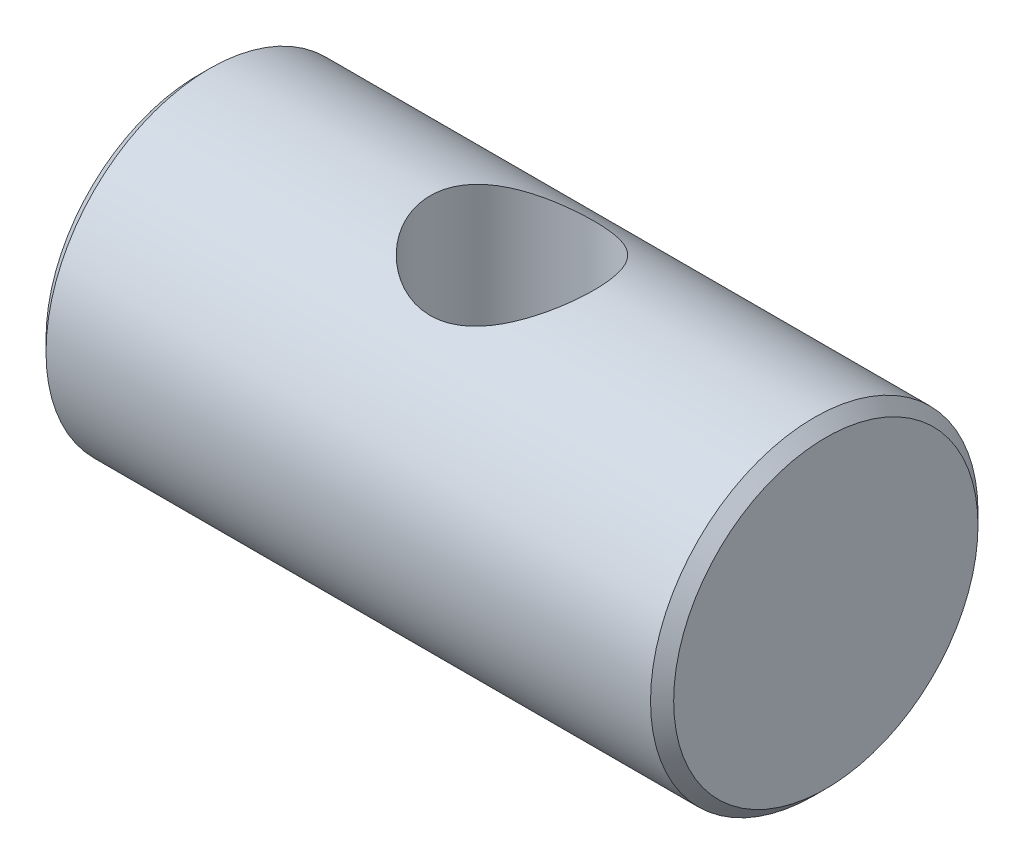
ISO-10303-21;
HEADER;
FILE_DESCRIPTION(('STEP AP214'),'2;1');
FILE_NAME('part.step','',(''),(''),'','','');
FILE_SCHEMA(('AUTOMOTIVE_DESIGN { 1 0 10303 214 1 1 1 1 }'));
ENDSEC;
DATA;
#1=APPLICATION_CONTEXT('core data for automotive mechanical design processes');
#2=APPLICATION_PROTOCOL_DEFINITION('international standard','automotive_design',2000,#1);
#3=PRODUCT_CONTEXT('',#1,'mechanical');
#4=PRODUCT('Part','Part','',(#3));
#5=PRODUCT_RELATED_PRODUCT_CATEGORY('part','',(#4));
#6=PRODUCT_DEFINITION_FORMATION('','',#4);
#7=PRODUCT_DEFINITION_CONTEXT('part definition',#1,'design');
#8=PRODUCT_DEFINITION('design','',#6,#7);
#9=PRODUCT_DEFINITION_SHAPE('','',#8);
#10=(LENGTH_UNIT() NAMED_UNIT(*) SI_UNIT(.MILLI.,.METRE.));
#11=(NAMED_UNIT(*) PLANE_ANGLE_UNIT() SI_UNIT($,.RADIAN.));
#12=(NAMED_UNIT(*) SI_UNIT($,.STERADIAN.) SOLID_ANGLE_UNIT());
#13=UNCERTAINTY_MEASURE_WITH_UNIT(LENGTH_MEASURE(1.E-05),#10,'distance_accuracy_value','');
#14=(GEOMETRIC_REPRESENTATION_CONTEXT(3) GLOBAL_UNCERTAINTY_ASSIGNED_CONTEXT((#13)) GLOBAL_UNIT_ASSIGNED_CONTEXT((#10,
#11,#12)) REPRESENTATION_CONTEXT('',''));
#15=CARTESIAN_POINT('',(0.,0.,0.));
#16=DIRECTION('',(0.,0.,1.));
#17=DIRECTION('',(1.,0.,0.));
#18=AXIS2_PLACEMENT_3D('',#15,#16,#17);
#19=CARTESIAN_POINT('',(5.75,2.78786796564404,0.));
#20=DIRECTION('',(-1.,0.,0.));
#21=DIRECTION('',(0.,0.,1.));
#22=AXIS2_PLACEMENT_3D('',#19,#20,#21);
#23=PLANE('',#22);
#24=CARTESIAN_POINT('',(5.74999999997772,0.,0.));
#25=DIRECTION('',(-1.,0.,0.));
#26=DIRECTION('',(0.,0.,1.));
#27=AXIS2_PLACEMENT_3D('',#24,#25,#26);
#28=CIRCLE('',#27,2.78786796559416);
#29=CARTESIAN_POINT('',(5.74999999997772,0.,-2.78786796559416));
#30=VERTEX_POINT('',#29);
#31=EDGE_CURVE('E31',#30,#30,#28,.T.);
#32=ORIENTED_EDGE('',*,*,#31,.F.);
#33=EDGE_LOOP('',(#32));
#34=FACE_BOUND('',#33,.T.);
#35=ADVANCED_FACE('F14',(#34),#23,.F.);
#36=CARTESIAN_POINT('',(-5.75,0.,0.));
#37=DIRECTION('',(1.,0.,0.));
#38=DIRECTION('',(0.,0.,-1.));
#39=AXIS2_PLACEMENT_3D('',#36,#37,#38);
#40=PLANE('',#39);
#41=CARTESIAN_POINT('',(-5.75000000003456,0.,0.));
#42=DIRECTION('',(1.,0.,0.));
#43=DIRECTION('',(0.,0.,-1.));
#44=AXIS2_PLACEMENT_3D('',#41,#42,#43);
#45=CIRCLE('',#44,2.78786796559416);
#46=CARTESIAN_POINT('',(-5.75000000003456,0.,-2.78786796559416));
#47=VERTEX_POINT('',#46);
#48=EDGE_CURVE('E44',#47,#47,#45,.T.);
#49=ORIENTED_EDGE('',*,*,#48,.F.);
#50=EDGE_LOOP('',(#49));
#51=FACE_BOUND('',#50,.T.);
#52=ADVANCED_FACE('F45',(#51),#40,.F.);
#53=CARTESIAN_POINT('',(5.53786796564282,0.,0.));
#54=DIRECTION('',(-1.,0.,0.));
#55=DIRECTION('',(0.,0.,1.));
#56=AXIS2_PLACEMENT_3D('',#53,#54,#55);
#57=CONICAL_SURFACE('',#56,2.99999999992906,0.785398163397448);
#58=CARTESIAN_POINT('',(5.53786796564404,0.,0.));
#59=DIRECTION('',(1.,0.,0.));
#60=DIRECTION('',(0.,0.,-1.));
#61=AXIS2_PLACEMENT_3D('',#58,#59,#60);
#62=CIRCLE('',#61,3.);
#63=CARTESIAN_POINT('',(5.53786796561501,0.,-2.99999999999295));
#64=VERTEX_POINT('',#63);
#65=EDGE_CURVE('E37',#64,#64,#62,.T.);
#66=ORIENTED_EDGE('',*,*,#65,.T.);
#67=EDGE_LOOP('',(#66));
#68=FACE_BOUND('',#67,.T.);
#69=ORIENTED_EDGE('',*,*,#31,.T.);
#70=EDGE_LOOP('',(#69));
#71=FACE_BOUND('',#70,.T.);
#72=ADVANCED_FACE('F75',(#68,#71),#57,.T.);
#73=CARTESIAN_POINT('',(5.75,0.,0.));
#74=DIRECTION('',(1.,0.,0.));
#75=DIRECTION('',(0.,0.,-1.));
#76=AXIS2_PLACEMENT_3D('',#73,#74,#75);
#77=CYLINDRICAL_SURFACE('',#76,3.);
#78=CARTESIAN_POINT('',(1.5,-3.00000000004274,0.));
#79=CARTESIAN_POINT('',(1.49999504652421,-2.99999570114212,0.0788579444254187));
#80=CARTESIAN_POINT('',(1.49374489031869,-2.99685736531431,0.157809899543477));
#81=CARTESIAN_POINT('',(1.46902067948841,-2.98461234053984,0.313380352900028));
#82=CARTESIAN_POINT('',(1.45052341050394,-2.97549431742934,0.389994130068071));
#83=CARTESIAN_POINT('',(1.40220928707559,-2.95224419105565,0.538400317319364));
#84=CARTESIAN_POINT('',(1.37243642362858,-2.93813158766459,0.610210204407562));
#85=CARTESIAN_POINT('',(1.3026440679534,-2.90618664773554,0.747708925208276));
#86=CARTESIAN_POINT('',(1.26262538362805,-2.88835460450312,0.813398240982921));
#87=CARTESIAN_POINT('',(1.17072412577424,-2.8493438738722,0.941261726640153));
#88=CARTESIAN_POINT('',(1.118270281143,-2.82802798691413,1.00298281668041));
#89=CARTESIAN_POINT('',(1.00421778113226,-2.78489955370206,1.11716916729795));
#90=CARTESIAN_POINT('',(0.942612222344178,-2.76308664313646,1.16962737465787));
#91=CARTESIAN_POINT('',(0.806274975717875,-2.71948426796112,1.26787800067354));
#92=CARTESIAN_POINT('',(0.730895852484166,-2.69782780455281,1.31283800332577));
#93=CARTESIAN_POINT('',(0.572448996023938,-2.65928968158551,1.3892523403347));
#94=CARTESIAN_POINT('',(0.489386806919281,-2.64240461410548,1.42071632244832));
#95=CARTESIAN_POINT('',(0.323002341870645,-2.61686800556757,1.46719866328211));
#96=CARTESIAN_POINT('',(0.23999332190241,-2.60778407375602,1.4830887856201));
#97=CARTESIAN_POINT('',(0.072031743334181,-2.59772834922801,1.50064048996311));
#98=CARTESIAN_POINT('',(-0.0129188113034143,-2.5967485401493,1.50231613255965));
#99=CARTESIAN_POINT('',(-0.17142903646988,-2.60266395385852,1.49203093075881));
#100=CARTESIAN_POINT('',(-0.245136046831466,-2.60863145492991,1.48167683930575));
#101=CARTESIAN_POINT('',(-0.389582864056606,-2.62614343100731,1.4504097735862));
#102=CARTESIAN_POINT('',(-0.460321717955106,-2.63768968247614,1.4294934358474));
#103=CARTESIAN_POINT('',(-0.598843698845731,-2.6653121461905,1.3773146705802));
#104=CARTESIAN_POINT('',(-0.666519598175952,-2.6814876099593,1.34582260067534));
#105=CARTESIAN_POINT('',(-0.795951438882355,-2.71655106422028,1.27356253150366));
#106=CARTESIAN_POINT('',(-0.857704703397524,-2.73544027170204,1.23279036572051));
#107=CARTESIAN_POINT('',(-0.981781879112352,-2.77669736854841,1.13709908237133));
#108=CARTESIAN_POINT('',(-1.04318531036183,-2.79920265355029,1.08104168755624));
#109=CARTESIAN_POINT('',(-1.15610312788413,-2.8432143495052,0.959333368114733));
#110=CARTESIAN_POINT('',(-1.20761278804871,-2.86472027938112,0.893677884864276));
#111=CARTESIAN_POINT('',(-1.30152849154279,-2.90552980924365,0.750774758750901));
#112=CARTESIAN_POINT('',(-1.34340070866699,-2.92468476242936,0.673130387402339));
#113=CARTESIAN_POINT('',(-1.41314554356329,-2.95736821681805,0.51069932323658));
#114=CARTESIAN_POINT('',(-1.44102927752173,-2.9709011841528,0.425918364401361));
#115=CARTESIAN_POINT('',(-1.47971310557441,-2.98986500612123,0.259149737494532));
#116=CARTESIAN_POINT('',(-1.49173685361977,-2.99587407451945,0.177512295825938));
#117=CARTESIAN_POINT('',(-1.50219709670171,-3.00109520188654,0.013169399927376));
#118=CARTESIAN_POINT('',(-1.50064002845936,-3.00031048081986,-0.0695355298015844));
#119=CARTESIAN_POINT('',(-1.48468996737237,-2.99236788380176,-0.226849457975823));
#120=CARTESIAN_POINT('',(-1.47130120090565,-2.98570868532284,-0.301589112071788));
#121=CARTESIAN_POINT('',(-1.43364289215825,-2.96733256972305,-0.447610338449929));
#122=CARTESIAN_POINT('',(-1.40937215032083,-2.95561509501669,-0.518891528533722));
#123=CARTESIAN_POINT('',(-1.35000230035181,-2.92776377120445,-0.658332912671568));
#124=CARTESIAN_POINT('',(-1.31461342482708,-2.91151322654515,-0.726345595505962));
#125=CARTESIAN_POINT('',(-1.23433869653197,-2.87615961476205,-0.855692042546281));
#126=CARTESIAN_POINT('',(-1.18944879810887,-2.8570553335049,-0.91702294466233));
#127=CARTESIAN_POINT('',(-1.08635936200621,-2.81562332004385,-1.03765153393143));
#128=CARTESIAN_POINT('',(-1.02728569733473,-2.79316327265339,-1.09615811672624));
#129=CARTESIAN_POINT('',(-0.900112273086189,-2.74893587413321,-1.2027844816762));
#130=CARTESIAN_POINT('',(-0.832006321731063,-2.72716901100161,-1.25089707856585));
#131=CARTESIAN_POINT('',(-0.684534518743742,-2.68576788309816,-1.33756187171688));
#132=CARTESIAN_POINT('',(-0.604783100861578,-2.66628794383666,-1.37553824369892));
#133=CARTESIAN_POINT('',(-0.438734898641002,-2.6336110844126,-1.437124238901));
#134=CARTESIAN_POINT('',(-0.352446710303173,-2.62040607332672,-1.46075237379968));
#135=CARTESIAN_POINT('',(-0.184634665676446,-2.60342251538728,-1.49079253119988));
#136=CARTESIAN_POINT('',(-0.10344861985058,-2.59886075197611,-1.49863949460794));
#137=CARTESIAN_POINT('',(0.0591706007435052,-2.59748031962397,-1.50103373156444));
#138=CARTESIAN_POINT('',(0.14060365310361,-2.60065829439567,-1.49558676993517));
#139=CARTESIAN_POINT('',(0.293225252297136,-2.61356793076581,-1.47288918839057));
#140=CARTESIAN_POINT('',(0.364650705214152,-2.62264641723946,-1.45681247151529));
#141=CARTESIAN_POINT('',(0.503712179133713,-2.64556524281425,-1.41476303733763));
#142=CARTESIAN_POINT('',(0.57134697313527,-2.65940711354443,-1.38878713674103));
#143=CARTESIAN_POINT('',(0.705937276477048,-2.69142795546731,-1.32572361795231));
#144=CARTESIAN_POINT('',(0.772541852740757,-2.709835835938,-1.28800670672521));
#145=CARTESIAN_POINT('',(0.898911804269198,-2.74852997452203,-1.2032264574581));
#146=CARTESIAN_POINT('',(0.958673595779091,-2.76881720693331,-1.15615825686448));
#147=CARTESIAN_POINT('',(1.07721297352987,-2.81193484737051,-1.04730498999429));
#148=CARTESIAN_POINT('',(1.13498865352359,-2.83477474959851,-0.984426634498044));
#149=CARTESIAN_POINT('',(1.23939447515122,-2.87816628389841,-0.849232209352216));
#150=CARTESIAN_POINT('',(1.28601860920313,-2.89871667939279,-0.776911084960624));
#151=CARTESIAN_POINT('',(1.3668545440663,-2.93547014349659,-0.623897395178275));
#152=CARTESIAN_POINT('',(1.40097625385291,-2.95164144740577,-0.543149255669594));
#153=CARTESIAN_POINT('',(1.45471225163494,-2.97752011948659,-0.376113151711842));
#154=CARTESIAN_POINT('',(1.4743677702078,-2.98724585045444,-0.289841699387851));
#155=CARTESIAN_POINT('',(1.49084611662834,-2.99543192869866,-0.168902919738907));
#156=CARTESIAN_POINT('',(1.49427396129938,-2.99714048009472,-0.135242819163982));
#157=CARTESIAN_POINT('',(1.49885199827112,-2.99942545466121,-0.067727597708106));
#158=CARTESIAN_POINT('',(1.50000212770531,-3.00000184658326,-0.033872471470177));
#159=CARTESIAN_POINT('',(1.5,-3.00000000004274,0.));
#160=B_SPLINE_CURVE_WITH_KNOTS('',3,(#78,#79,#80,#81,#82,#83,#84,#85,#86,#87,#88,#89,#90,#91,
#92,#93,#94,#95,#96,#97,#98,#99,#100,#101,#102,#103,#104,#105,#106,#107,#108,#109,#110,#111,
#112,#113,#114,#115,#116,#117,#118,#119,#120,#121,#122,#123,#124,#125,#126,#127,#128,#129,#130,
#131,#132,#133,#134,#135,#136,#137,#138,#139,#140,#141,#142,#143,#144,#145,#146,#147,#148,#149,
#150,#151,#152,#153,#154,#155,#156,#157,#158,#159),.UNSPECIFIED.,.T.,.F.,(4,2,2,2,2,2,2,2,2,2,2,
2,2,2,2,2,2,2,2,2,2,2,2,2,2,2,2,2,2,2,2,2,2,2,2,2,2,2,2,2,4),(0.,0.236436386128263,
0.473322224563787,0.709293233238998,0.945245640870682,1.19547263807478,1.44588935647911,
1.71572589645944,1.98536921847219,2.23887018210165,2.49212035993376,2.71508568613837,
2.93812205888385,3.16635360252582,3.39468781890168,3.65197412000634,3.90938301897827,
4.17874533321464,4.44789325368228,4.69474935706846,4.94148846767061,5.16910359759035,
5.39674382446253,5.63089284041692,5.86514176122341,6.12239415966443,6.37982382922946,
6.64972023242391,6.91926767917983,7.16293961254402,7.40650589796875,7.62686895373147,
7.84730293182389,8.08254685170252,8.31791341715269,8.58187864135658,8.84598575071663,
9.11196020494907,9.37717362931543,9.47872920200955,9.5802875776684),.UNSPECIFIED.);
#161=CARTESIAN_POINT('',(1.5,-3.00000000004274,0.));
#162=VERTEX_POINT('',#161);
#163=EDGE_CURVE('E9',#162,#162,#160,.T.);
#164=ORIENTED_EDGE('',*,*,#163,.F.);
#165=EDGE_LOOP('',(#164));
#166=FACE_BOUND('',#165,.T.);
#167=CARTESIAN_POINT('',(0.,2.59807621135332,1.5));
#168=CARTESIAN_POINT('',(0.0781617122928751,2.59808302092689,1.4999945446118));
#169=CARTESIAN_POINT('',(0.156422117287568,2.60165701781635,1.49384995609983));
#170=CARTESIAN_POINT('',(0.310540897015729,2.61543549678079,1.46958481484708));
#171=CARTESIAN_POINT('',(0.386393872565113,2.62565391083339,1.45143909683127));
#172=CARTESIAN_POINT('',(0.533177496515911,2.65124019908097,1.40414992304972));
#173=CARTESIAN_POINT('',(0.60413197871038,2.66658065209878,1.3750649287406));
#174=CARTESIAN_POINT('',(0.740136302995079,2.70063997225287,1.30690128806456));
#175=CARTESIAN_POINT('',(0.805185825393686,2.71935902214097,1.26782210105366));
#176=CARTESIAN_POINT('',(0.933458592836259,2.75995303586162,1.17699981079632));
#177=CARTESIAN_POINT('',(0.996088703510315,2.7819609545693,1.12447805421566));
#178=CARTESIAN_POINT('',(1.11211258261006,2.82557974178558,1.0098807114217));
#179=CARTESIAN_POINT('',(1.16550174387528,2.84719040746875,0.94780038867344));
#180=CARTESIAN_POINT('',(1.26505072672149,2.88932215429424,0.81073434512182));
#181=CARTESIAN_POINT('',(1.31048065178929,2.90967159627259,0.735160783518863));
#182=CARTESIAN_POINT('',(1.38771127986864,2.94526134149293,0.576235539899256));
#183=CARTESIAN_POINT('',(1.41952058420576,2.96050486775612,0.492888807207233));
#184=CARTESIAN_POINT('',(1.46625699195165,2.98320691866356,0.327067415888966));
#185=CARTESIAN_POINT('',(1.4822242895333,2.99114220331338,0.244952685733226));
#186=CARTESIAN_POINT('',(1.50024917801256,3.00011375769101,0.0788559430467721));
#187=CARTESIAN_POINT('',(1.50231518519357,3.00115420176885,-0.00512490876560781));
#188=CARTESIAN_POINT('',(1.49287998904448,2.99644472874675,-0.164748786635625));
#189=CARTESIAN_POINT('',(1.48254297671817,2.99127743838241,-0.240481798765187));
#190=CARTESIAN_POINT('',(1.45067873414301,2.97561367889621,-0.388970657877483));
#191=CARTESIAN_POINT('',(1.42915066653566,2.96511681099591,-0.461726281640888));
#192=CARTESIAN_POINT('',(1.37537615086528,2.93957374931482,-0.60346408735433));
#193=CARTESIAN_POINT('',(1.3429855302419,2.92446662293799,-0.672380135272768));
#194=CARTESIAN_POINT('',(1.26860487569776,2.89106468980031,-0.803965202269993));
#195=CARTESIAN_POINT('',(1.22661140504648,2.87276874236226,-0.866631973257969));
#196=CARTESIAN_POINT('',(1.12965697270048,2.83266591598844,-0.990260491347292));
#197=CARTESIAN_POINT('',(1.07384545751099,2.81069063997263,-1.05050111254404));
#198=CARTESIAN_POINT('',(0.953115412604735,2.76681510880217,-1.16115655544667));
#199=CARTESIAN_POINT('',(0.888189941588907,2.74491492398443,-1.21156381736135));
#200=CARTESIAN_POINT('',(0.746027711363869,2.70216234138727,-1.30425800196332));
#201=CARTESIAN_POINT('',(0.668270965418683,2.68146479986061,-1.34582597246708));
#202=CARTESIAN_POINT('',(0.505593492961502,2.64563175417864,-1.41497866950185));
#203=CARTESIAN_POINT('',(0.420680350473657,2.63049045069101,-1.44257798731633));
#204=CARTESIAN_POINT('',(0.253178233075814,2.60916953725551,-1.48077031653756));
#205=CARTESIAN_POINT('',(0.170938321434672,2.60237483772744,-1.49253768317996));
#206=CARTESIAN_POINT('',(0.00539798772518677,2.59676879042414,-1.50227541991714));
#207=CARTESIAN_POINT('',(-0.077901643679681,2.59795180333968,-1.50025553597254));
#208=CARTESIAN_POINT('',(-0.233480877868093,2.60751504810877,-1.48355406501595));
#209=CARTESIAN_POINT('',(-0.305969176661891,2.61509381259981,-1.4702817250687));
#210=CARTESIAN_POINT('',(-0.447551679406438,2.63541032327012,-1.43354442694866));
#211=CARTESIAN_POINT('',(-0.516644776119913,2.64814974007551,-1.41007616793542));
#212=CARTESIAN_POINT('',(-0.653116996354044,2.67804333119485,-1.35247138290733));
#213=CARTESIAN_POINT('',(-0.720268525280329,2.69537464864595,-1.31789109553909));
#214=CARTESIAN_POINT('',(-0.84820390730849,2.73234179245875,-1.23943059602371));
#215=CARTESIAN_POINT('',(-0.908984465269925,2.75197880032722,-1.19554560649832));
#216=CARTESIAN_POINT('',(-1.03046815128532,2.79431997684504,-1.09325575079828));
#217=CARTESIAN_POINT('',(-1.09019572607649,2.81709874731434,-1.03371790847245));
#218=CARTESIAN_POINT('',(-1.19911835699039,2.86101352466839,-0.905106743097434));
#219=CARTESIAN_POINT('',(-1.24830985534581,2.88214897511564,-0.836030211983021));
#220=CARTESIAN_POINT('',(-1.33586058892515,2.92112042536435,-0.687803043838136));
#221=CARTESIAN_POINT('',(-1.37389967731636,2.93885462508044,-0.60843464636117));
#222=CARTESIAN_POINT('',(-1.43570685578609,2.96825032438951,-0.443283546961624));
#223=CARTESIAN_POINT('',(-1.45948747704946,2.9799171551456,-0.357506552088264));
#224=CARTESIAN_POINT('',(-1.49005284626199,2.99501262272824,-0.190469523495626));
#225=CARTESIAN_POINT('',(-1.49819681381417,2.99909891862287,-0.109517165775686));
#226=CARTESIAN_POINT('',(-1.5012648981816,3.00063195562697,0.052688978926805));
#227=CARTESIAN_POINT('',(-1.49619364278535,2.99808102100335,0.13394265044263));
#228=CARTESIAN_POINT('',(-1.47387538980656,2.98700953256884,0.28880698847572));
#229=CARTESIAN_POINT('',(-1.45745272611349,2.97889342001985,0.362568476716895));
#230=CARTESIAN_POINT('',(-1.41400950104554,2.95788140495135,0.506168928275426));
#231=CARTESIAN_POINT('',(-1.38698741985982,2.94498481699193,0.576007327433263));
#232=CARTESIAN_POINT('',(-1.32190942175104,2.9148889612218,0.713135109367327));
#233=CARTESIAN_POINT('',(-1.28343101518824,2.89752925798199,0.78018771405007));
#234=CARTESIAN_POINT('',(-1.19706310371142,2.86032199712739,0.907161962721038));
#235=CARTESIAN_POINT('',(-1.14916927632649,2.84047329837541,0.967080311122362));
#236=CARTESIAN_POINT('',(-1.03980429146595,2.79792915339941,1.08437100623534));
#237=CARTESIAN_POINT('',(-0.977456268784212,2.77514698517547,1.14089652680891));
#238=CARTESIAN_POINT('',(-0.843823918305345,2.73094614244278,1.24299493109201));
#239=CARTESIAN_POINT('',(-0.772531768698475,2.70952868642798,1.28855812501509));
#240=CARTESIAN_POINT('',(-0.620045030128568,2.66999407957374,1.36864661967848));
#241=CARTESIAN_POINT('',(-0.538608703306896,2.65200261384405,1.40277759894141));
#242=CARTESIAN_POINT('',(-0.370001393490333,2.62299234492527,1.45631806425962));
#243=CARTESIAN_POINT('',(-0.282850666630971,2.61195024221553,1.47577678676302));
#244=CARTESIAN_POINT('',(-0.162291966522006,2.60293908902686,1.49155051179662));
#245=CARTESIAN_POINT('',(-0.129948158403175,2.60112193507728,1.49471415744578));
#246=CARTESIAN_POINT('',(-0.065075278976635,2.59868903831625,1.49894010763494));
#247=CARTESIAN_POINT('',(-0.0325461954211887,2.59807337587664,1.50000227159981));
#248=CARTESIAN_POINT('',(0.,2.59807621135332,1.5));
#249=B_SPLINE_CURVE_WITH_KNOTS('',3,(#167,#168,#169,#170,#171,#172,#173,#174,#175,#176,#177,
#178,#179,#180,#181,#182,#183,#184,#185,#186,#187,#188,#189,#190,#191,#192,#193,#194,#195,#196,
#197,#198,#199,#200,#201,#202,#203,#204,#205,#206,#207,#208,#209,#210,#211,#212,#213,#214,#215,
#216,#217,#218,#219,#220,#221,#222,#223,#224,#225,#226,#227,#228,#229,#230,#231,#232,#233,#234,
#235,#236,#237,#238,#239,#240,#241,#242,#243,#244,#245,#246,#247,#248),.UNSPECIFIED.,.T.,.F.,(4,
2,2,2,2,2,2,2,2,2,2,2,2,2,2,2,2,2,2,2,2,2,2,2,2,2,2,2,2,2,2,2,2,2,2,2,2,2,2,2,4),(0.,
0.234348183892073,0.469189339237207,0.702792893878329,0.936409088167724,1.18929346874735,
1.44230356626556,1.71236838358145,1.98226240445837,2.23295227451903,2.4834903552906,
2.71224146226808,2.94100968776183,3.1729430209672,3.40495949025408,3.65890787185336,
3.91305072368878,4.18333262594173,4.45333161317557,4.70193436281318,4.9503613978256,
5.17161275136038,5.39293578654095,5.62450944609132,5.85620229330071,6.1171011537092,
6.37808797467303,6.64596272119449,6.91360169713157,7.1566840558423,7.39968130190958,
7.62666637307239,7.8536840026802,8.09041126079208,8.32724745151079,8.58765362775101,
8.84828914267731,9.11716123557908,9.38512699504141,9.48270202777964,9.58028358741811),.UNSPECIFIED.);
#250=CARTESIAN_POINT('',(0.,2.59807621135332,1.5));
#251=VERTEX_POINT('',#250);
#252=EDGE_CURVE('E26',#251,#251,#249,.T.);
#253=ORIENTED_EDGE('',*,*,#252,.F.);
#254=EDGE_LOOP('',(#253));
#255=FACE_BOUND('',#254,.T.);
#256=ORIENTED_EDGE('',*,*,#65,.F.);
#257=EDGE_LOOP('',(#256));
#258=FACE_BOUND('',#257,.T.);
#259=CARTESIAN_POINT('',(-5.53786796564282,0.,0.));
#260=DIRECTION('',(1.,0.,0.));
#261=DIRECTION('',(0.,0.,-1.));
#262=AXIS2_PLACEMENT_3D('',#259,#260,#261);
#263=CIRCLE('',#262,3.00000000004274);
#264=CARTESIAN_POINT('',(-5.53786796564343,0.,-3.00000000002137));
#265=VERTEX_POINT('',#264);
#266=EDGE_CURVE('E47',#265,#265,#263,.F.);
#267=ORIENTED_EDGE('',*,*,#266,.F.);
#268=EDGE_LOOP('',(#267));
#269=FACE_BOUND('',#268,.T.);
#270=ADVANCED_FACE('F59',(#166,#255,#258,#269),#77,.T.);
#271=CARTESIAN_POINT('',(-5.53786796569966,0.,0.));
#272=DIRECTION('',(1.,0.,0.));
#273=DIRECTION('',(0.,0.,-1.));
#274=AXIS2_PLACEMENT_3D('',#271,#272,#273);
#275=CONICAL_SURFACE('',#274,2.99999999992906,0.785398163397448);
#276=ORIENTED_EDGE('',*,*,#48,.T.);
#277=EDGE_LOOP('',(#276));
#278=FACE_BOUND('',#277,.T.);
#279=ORIENTED_EDGE('',*,*,#266,.T.);
#280=EDGE_LOOP('',(#279));
#281=FACE_BOUND('',#280,.T.);
#282=ADVANCED_FACE('F66',(#278,#281),#275,.T.);
#283=CARTESIAN_POINT('',(0.,-3.00000000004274,0.));
#284=DIRECTION('',(0.,1.,0.));
#285=DIRECTION('',(0.,0.,1.));
#286=AXIS2_PLACEMENT_3D('',#283,#284,#285);
#287=CYLINDRICAL_SURFACE('',#286,1.5);
#288=ORIENTED_EDGE('',*,*,#163,.T.);
#289=EDGE_LOOP('',(#288));
#290=FACE_BOUND('',#289,.T.);
#291=ORIENTED_EDGE('',*,*,#252,.T.);
#292=EDGE_LOOP('',(#291));
#293=FACE_BOUND('',#292,.T.);
#294=ADVANCED_FACE('F63',(#290,#293),#287,.F.);
#295=CLOSED_SHELL('',(#35,#52,#72,#270,#282,#294));
#296=MANIFOLD_SOLID_BREP('B1',#295);
#297=ADVANCED_BREP_SHAPE_REPRESENTATION('',(#18,#296),#14);
#298=SHAPE_DEFINITION_REPRESENTATION(#9,#297);
ENDSEC;
END-ISO-10303-21;
